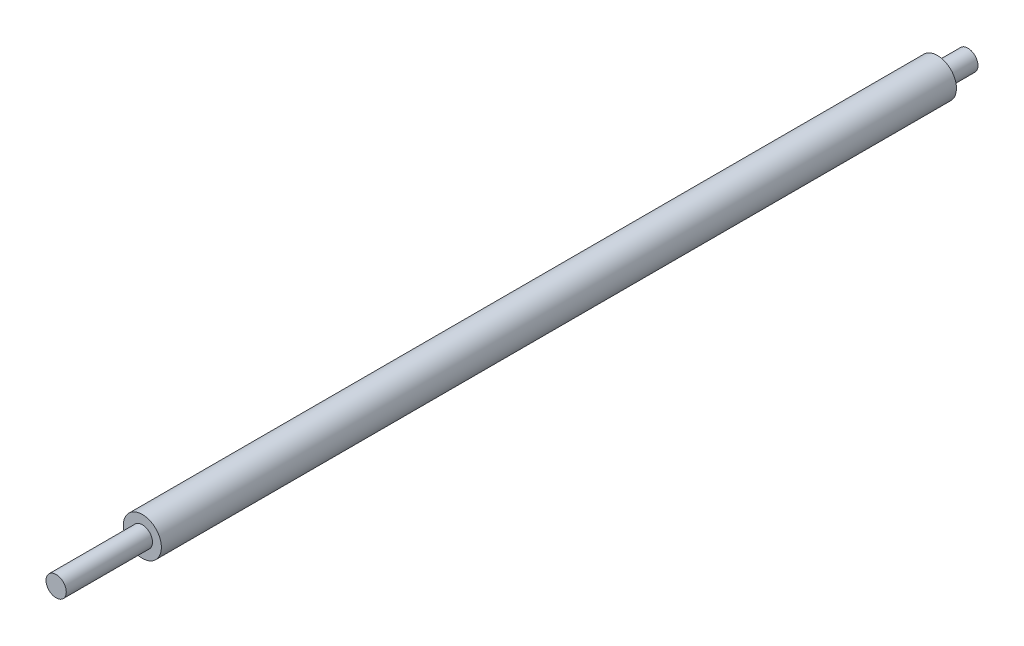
ISO-10303-21;
HEADER;
FILE_DESCRIPTION(('STEP AP214'),'2;1');
FILE_NAME('part.step','',(''),(''),'','','');
FILE_SCHEMA(('AUTOMOTIVE_DESIGN { 1 0 10303 214 1 1 1 1 }'));
ENDSEC;
DATA;
#1=APPLICATION_CONTEXT('core data for automotive mechanical design processes');
#2=APPLICATION_PROTOCOL_DEFINITION('international standard','automotive_design',2000,#1);
#3=PRODUCT_CONTEXT('',#1,'mechanical');
#4=PRODUCT('Part','Part','',(#3));
#5=PRODUCT_RELATED_PRODUCT_CATEGORY('part','',(#4));
#6=PRODUCT_DEFINITION_FORMATION('','',#4);
#7=PRODUCT_DEFINITION_CONTEXT('part definition',#1,'design');
#8=PRODUCT_DEFINITION('design','',#6,#7);
#9=PRODUCT_DEFINITION_SHAPE('','',#8);
#10=(LENGTH_UNIT() NAMED_UNIT(*) SI_UNIT(.MILLI.,.METRE.));
#11=(NAMED_UNIT(*) PLANE_ANGLE_UNIT() SI_UNIT($,.RADIAN.));
#12=(NAMED_UNIT(*) SI_UNIT($,.STERADIAN.) SOLID_ANGLE_UNIT());
#13=UNCERTAINTY_MEASURE_WITH_UNIT(LENGTH_MEASURE(1.E-05),#10,'distance_accuracy_value','');
#14=(GEOMETRIC_REPRESENTATION_CONTEXT(3) GLOBAL_UNCERTAINTY_ASSIGNED_CONTEXT((#13)) GLOBAL_UNIT_ASSIGNED_CONTEXT((#10,
#11,#12)) REPRESENTATION_CONTEXT('',''));
#15=CARTESIAN_POINT('',(0.,0.,0.));
#16=DIRECTION('',(0.,0.,1.));
#17=DIRECTION('',(1.,0.,0.));
#18=AXIS2_PLACEMENT_3D('',#15,#16,#17);
#19=CARTESIAN_POINT('',(0.,0.,0.));
#20=DIRECTION('',(0.,0.,1.));
#21=DIRECTION('',(1.,0.,0.));
#22=AXIS2_PLACEMENT_3D('',#19,#20,#21);
#23=PLANE('',#22);
#24=CARTESIAN_POINT('',(0.,0.,0.));
#25=DIRECTION('',(0.,0.,1.));
#26=DIRECTION('',(1.,0.,0.));
#27=AXIS2_PLACEMENT_3D('',#24,#25,#26);
#28=CIRCLE('',#27,7.5);
#29=CARTESIAN_POINT('',(7.5,0.,0.));
#30=VERTEX_POINT('',#29);
#31=EDGE_CURVE('E39',#30,#30,#28,.T.);
#32=ORIENTED_EDGE('',*,*,#31,.F.);
#33=EDGE_LOOP('',(#32));
#34=FACE_BOUND('',#33,.T.);
#35=CARTESIAN_POINT('',(0.,0.,0.));
#36=DIRECTION('',(0.,0.,1.));
#37=DIRECTION('',(1.,0.,0.));
#38=AXIS2_PLACEMENT_3D('',#35,#36,#37);
#39=CIRCLE('',#38,4.);
#40=CARTESIAN_POINT('',(4.,0.,0.));
#41=VERTEX_POINT('',#40);
#42=EDGE_CURVE('E10',#41,#41,#39,.F.);
#43=ORIENTED_EDGE('',*,*,#42,.F.);
#44=EDGE_LOOP('',(#43));
#45=FACE_BOUND('',#44,.T.);
#46=ADVANCED_FACE('F28',(#34,#45),#23,.F.);
#47=CARTESIAN_POINT('',(0.,0.,313.5));
#48=DIRECTION('',(0.,0.,1.));
#49=DIRECTION('',(1.,0.,0.));
#50=AXIS2_PLACEMENT_3D('',#47,#48,#49);
#51=PLANE('',#50);
#52=CARTESIAN_POINT('',(0.,0.,313.5));
#53=DIRECTION('',(0.,0.,1.));
#54=DIRECTION('',(1.,0.,0.));
#55=AXIS2_PLACEMENT_3D('',#52,#53,#54);
#56=CIRCLE('',#55,7.5);
#57=CARTESIAN_POINT('',(7.5,0.,313.5));
#58=VERTEX_POINT('',#57);
#59=EDGE_CURVE('E35',#58,#58,#56,.T.);
#60=ORIENTED_EDGE('',*,*,#59,.T.);
#61=EDGE_LOOP('',(#60));
#62=FACE_BOUND('',#61,.T.);
#63=CARTESIAN_POINT('',(0.,0.,313.5));
#64=DIRECTION('',(0.,0.,1.));
#65=DIRECTION('',(1.,0.,0.));
#66=AXIS2_PLACEMENT_3D('',#63,#64,#65);
#67=CIRCLE('',#66,4.);
#68=CARTESIAN_POINT('',(4.,0.,313.5));
#69=VERTEX_POINT('',#68);
#70=EDGE_CURVE('E46',#69,#69,#67,.T.);
#71=ORIENTED_EDGE('',*,*,#70,.F.);
#72=EDGE_LOOP('',(#71));
#73=FACE_BOUND('',#72,.T.);
#74=ADVANCED_FACE('F70',(#62,#73),#51,.T.);
#75=CARTESIAN_POINT('',(0.,0.,313.5));
#76=DIRECTION('',(0.,0.,-1.));
#77=DIRECTION('',(-1.,0.,0.));
#78=AXIS2_PLACEMENT_3D('',#75,#76,#77);
#79=CYLINDRICAL_SURFACE('',#78,7.5);
#80=ORIENTED_EDGE('',*,*,#59,.F.);
#81=EDGE_LOOP('',(#80));
#82=FACE_BOUND('',#81,.T.);
#83=ORIENTED_EDGE('',*,*,#31,.T.);
#84=EDGE_LOOP('',(#83));
#85=FACE_BOUND('',#84,.T.);
#86=ADVANCED_FACE('F30',(#82,#85),#79,.T.);
#87=CARTESIAN_POINT('',(0.,0.,347.5));
#88=DIRECTION('',(0.,0.,-1.));
#89=DIRECTION('',(-1.,0.,0.));
#90=AXIS2_PLACEMENT_3D('',#87,#88,#89);
#91=CYLINDRICAL_SURFACE('',#90,4.);
#92=CARTESIAN_POINT('',(0.,0.,347.5));
#93=DIRECTION('',(0.,0.,1.));
#94=DIRECTION('',(1.,0.,0.));
#95=AXIS2_PLACEMENT_3D('',#92,#93,#94);
#96=CIRCLE('',#95,4.);
#97=CARTESIAN_POINT('',(4.,0.,347.5));
#98=VERTEX_POINT('',#97);
#99=EDGE_CURVE('E44',#98,#98,#96,.T.);
#100=ORIENTED_EDGE('',*,*,#99,.F.);
#101=EDGE_LOOP('',(#100));
#102=FACE_BOUND('',#101,.T.);
#103=ORIENTED_EDGE('',*,*,#70,.T.);
#104=EDGE_LOOP('',(#103));
#105=FACE_BOUND('',#104,.T.);
#106=ADVANCED_FACE('F66',(#102,#105),#91,.T.);
#107=CARTESIAN_POINT('',(0.,0.,347.5));
#108=DIRECTION('',(0.,0.,1.));
#109=DIRECTION('',(1.,0.,0.));
#110=AXIS2_PLACEMENT_3D('',#107,#108,#109);
#111=PLANE('',#110);
#112=ORIENTED_EDGE('',*,*,#99,.T.);
#113=EDGE_LOOP('',(#112));
#114=FACE_BOUND('',#113,.T.);
#115=ADVANCED_FACE('F59',(#114),#111,.T.);
#116=CARTESIAN_POINT('',(0.,0.,-12.));
#117=DIRECTION('',(0.,0.,1.));
#118=DIRECTION('',(1.,0.,0.));
#119=AXIS2_PLACEMENT_3D('',#116,#117,#118);
#120=CYLINDRICAL_SURFACE('',#119,4.);
#121=CARTESIAN_POINT('',(0.,0.,-12.));
#122=DIRECTION('',(0.,0.,-1.));
#123=DIRECTION('',(-1.,0.,0.));
#124=AXIS2_PLACEMENT_3D('',#121,#122,#123);
#125=CIRCLE('',#124,4.);
#126=CARTESIAN_POINT('',(-4.,0.,-12.));
#127=VERTEX_POINT('',#126);
#128=EDGE_CURVE('E49',#127,#127,#125,.T.);
#129=ORIENTED_EDGE('',*,*,#128,.F.);
#130=EDGE_LOOP('',(#129));
#131=FACE_BOUND('',#130,.T.);
#132=ORIENTED_EDGE('',*,*,#42,.T.);
#133=EDGE_LOOP('',(#132));
#134=FACE_BOUND('',#133,.T.);
#135=ADVANCED_FACE('F57',(#131,#134),#120,.T.);
#136=CARTESIAN_POINT('',(0.,0.,-12.));
#137=DIRECTION('',(0.,0.,-1.));
#138=DIRECTION('',(-1.,0.,0.));
#139=AXIS2_PLACEMENT_3D('',#136,#137,#138);
#140=PLANE('',#139);
#141=ORIENTED_EDGE('',*,*,#128,.T.);
#142=EDGE_LOOP('',(#141));
#143=FACE_BOUND('',#142,.T.);
#144=ADVANCED_FACE('F55',(#143),#140,.T.);
#145=CLOSED_SHELL('',(#46,#74,#86,#106,#115,#135,#144));
#146=MANIFOLD_SOLID_BREP('B2',#145);
#147=ADVANCED_BREP_SHAPE_REPRESENTATION('',(#18,#146),#14);
#148=SHAPE_DEFINITION_REPRESENTATION(#9,#147);
ENDSEC;
END-ISO-10303-21;
